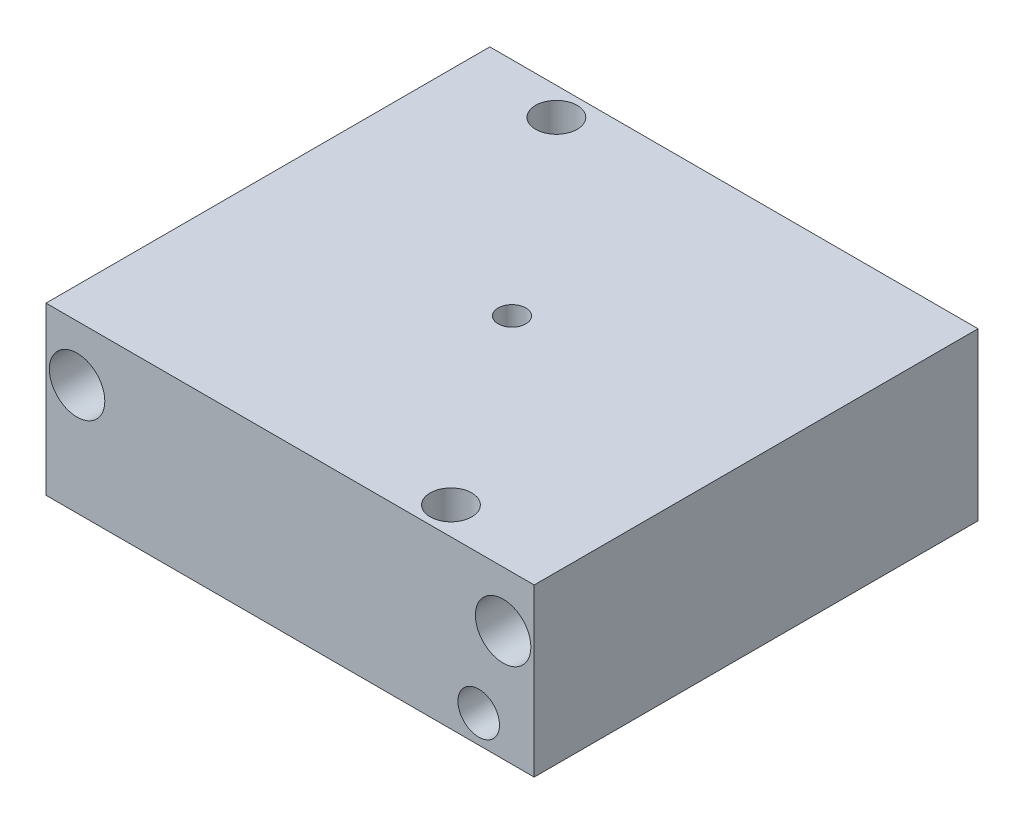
ISO-10303-21;
HEADER;
FILE_DESCRIPTION(('STEP AP214'),'2;1');
FILE_NAME('part.step','',(''),(''),'','','');
FILE_SCHEMA(('AUTOMOTIVE_DESIGN { 1 0 10303 214 1 1 1 1 }'));
ENDSEC;
DATA;
#1=APPLICATION_CONTEXT('core data for automotive mechanical design processes');
#2=APPLICATION_PROTOCOL_DEFINITION('international standard','automotive_design',2000,#1);
#3=PRODUCT_CONTEXT('',#1,'mechanical');
#4=PRODUCT('Part','Part','',(#3));
#5=PRODUCT_RELATED_PRODUCT_CATEGORY('part','',(#4));
#6=PRODUCT_DEFINITION_FORMATION('','',#4);
#7=PRODUCT_DEFINITION_CONTEXT('part definition',#1,'design');
#8=PRODUCT_DEFINITION('design','',#6,#7);
#9=PRODUCT_DEFINITION_SHAPE('','',#8);
#10=(LENGTH_UNIT() NAMED_UNIT(*) SI_UNIT(.MILLI.,.METRE.));
#11=(NAMED_UNIT(*) PLANE_ANGLE_UNIT() SI_UNIT($,.RADIAN.));
#12=(NAMED_UNIT(*) SI_UNIT($,.STERADIAN.) SOLID_ANGLE_UNIT());
#13=UNCERTAINTY_MEASURE_WITH_UNIT(LENGTH_MEASURE(1.E-05),#10,'distance_accuracy_value','');
#14=(GEOMETRIC_REPRESENTATION_CONTEXT(3) GLOBAL_UNCERTAINTY_ASSIGNED_CONTEXT((#13)) GLOBAL_UNIT_ASSIGNED_CONTEXT((#10,
#11,#12)) REPRESENTATION_CONTEXT('',''));
#15=CARTESIAN_POINT('',(0.,0.,0.));
#16=DIRECTION('',(0.,0.,1.));
#17=DIRECTION('',(1.,0.,0.));
#18=AXIS2_PLACEMENT_3D('',#15,#16,#17);
#19=CARTESIAN_POINT('',(-58.9430139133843,38.1,-69.2318832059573));
#20=DIRECTION('',(1.,0.,0.));
#21=DIRECTION('',(0.,0.,-1.));
#22=AXIS2_PLACEMENT_3D('',#19,#20,#21);
#23=PLANE('',#22);
#24=DIRECTION('',(0.,0.,1.));
#25=VECTOR('',#24,1.);
#26=CARTESIAN_POINT('',(-58.9430139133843,0.,-69.2318832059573));
#27=LINE('',#26,#25);
#28=CARTESIAN_POINT('',(-58.9430139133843,0.,-69.2318832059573));
#29=VERTEX_POINT('',#28);
#30=CARTESIAN_POINT('',(-58.9430139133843,0.,32.3681167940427));
#31=VERTEX_POINT('',#30);
#32=EDGE_CURVE('E78',#29,#31,#27,.T.);
#33=ORIENTED_EDGE('',*,*,#32,.T.);
#34=DIRECTION('',(0.,-1.,0.));
#35=VECTOR('',#34,1.);
#36=CARTESIAN_POINT('',(-58.9430139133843,38.1,32.3681167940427));
#37=LINE('',#36,#35);
#38=CARTESIAN_POINT('',(-58.9430139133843,38.1,32.3681167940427));
#39=VERTEX_POINT('',#38);
#40=EDGE_CURVE('E11',#39,#31,#37,.T.);
#41=ORIENTED_EDGE('',*,*,#40,.F.);
#42=DIRECTION('',(0.,0.,1.));
#43=VECTOR('',#42,1.);
#44=CARTESIAN_POINT('',(-58.9430139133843,38.1,-69.2318832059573));
#45=LINE('',#44,#43);
#46=CARTESIAN_POINT('',(-58.9430139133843,38.1,-69.2318832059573));
#47=VERTEX_POINT('',#46);
#48=EDGE_CURVE('E101',#47,#39,#45,.T.);
#49=ORIENTED_EDGE('',*,*,#48,.F.);
#50=DIRECTION('',(0.,-1.,0.));
#51=VECTOR('',#50,1.);
#52=CARTESIAN_POINT('',(-58.9430139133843,38.1,-69.2318832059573));
#53=LINE('',#52,#51);
#54=EDGE_CURVE('E90',#47,#29,#53,.T.);
#55=ORIENTED_EDGE('',*,*,#54,.T.);
#56=EDGE_LOOP('',(#33,#41,#49,#55));
#57=FACE_BOUND('',#56,.T.);
#58=ADVANCED_FACE('F32',(#57),#23,.F.);
#59=CARTESIAN_POINT('',(-58.9430139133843,38.1,32.3681167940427));
#60=DIRECTION('',(0.,0.,-1.));
#61=DIRECTION('',(-1.,0.,0.));
#62=AXIS2_PLACEMENT_3D('',#59,#60,#61);
#63=PLANE('',#62);
#64=CARTESIAN_POINT('',(-51.8310139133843,25.4,32.3681167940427));
#65=DIRECTION('',(0.,0.,1.));
#66=DIRECTION('',(1.,0.,0.));
#67=AXIS2_PLACEMENT_3D('',#64,#65,#66);
#68=CIRCLE('',#67,6.35);
#69=CARTESIAN_POINT('',(-45.4810139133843,25.4,32.3681167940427));
#70=VERTEX_POINT('',#69);
#71=EDGE_CURVE('E121',#70,#70,#68,.T.);
#72=ORIENTED_EDGE('',*,*,#71,.F.);
#73=EDGE_LOOP('',(#72));
#74=FACE_BOUND('',#73,.T.);
#75=CARTESIAN_POINT('',(45.7049860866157,25.3999999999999,32.3681167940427));
#76=DIRECTION('',(0.,0.,1.));
#77=DIRECTION('',(1.,0.,0.));
#78=AXIS2_PLACEMENT_3D('',#75,#76,#77);
#79=CIRCLE('',#78,6.35000000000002);
#80=CARTESIAN_POINT('',(52.0549860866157,25.3999999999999,32.3681167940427));
#81=VERTEX_POINT('',#80);
#82=EDGE_CURVE('E112',#81,#81,#79,.T.);
#83=ORIENTED_EDGE('',*,*,#82,.F.);
#84=EDGE_LOOP('',(#83));
#85=FACE_BOUND('',#84,.T.);
#86=CARTESIAN_POINT('',(40.1169860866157,6.35,32.3681167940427));
#87=DIRECTION('',(0.,0.,1.));
#88=DIRECTION('',(1.,0.,0.));
#89=AXIS2_PLACEMENT_3D('',#86,#87,#88);
#90=CIRCLE('',#89,4.7625);
#91=CARTESIAN_POINT('',(44.8794860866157,6.35,32.3681167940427));
#92=VERTEX_POINT('',#91);
#93=EDGE_CURVE('E94',#92,#92,#90,.T.);
#94=ORIENTED_EDGE('',*,*,#93,.F.);
#95=EDGE_LOOP('',(#94));
#96=FACE_BOUND('',#95,.T.);
#97=DIRECTION('',(1.,0.,0.));
#98=VECTOR('',#97,1.);
#99=CARTESIAN_POINT('',(-58.9430139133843,0.,32.3681167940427));
#100=LINE('',#99,#98);
#101=CARTESIAN_POINT('',(52.8169860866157,0.,32.3681167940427));
#102=VERTEX_POINT('',#101);
#103=EDGE_CURVE('E74',#31,#102,#100,.T.);
#104=ORIENTED_EDGE('',*,*,#103,.T.);
#105=DIRECTION('',(0.,-1.,0.));
#106=VECTOR('',#105,1.);
#107=CARTESIAN_POINT('',(52.8169860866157,38.1,32.3681167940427));
#108=LINE('',#107,#106);
#109=CARTESIAN_POINT('',(52.8169860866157,38.1,32.3681167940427));
#110=VERTEX_POINT('',#109);
#111=EDGE_CURVE('E40',#110,#102,#108,.T.);
#112=ORIENTED_EDGE('',*,*,#111,.F.);
#113=DIRECTION('',(1.,0.,0.));
#114=VECTOR('',#113,1.);
#115=CARTESIAN_POINT('',(-58.9430139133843,38.1,32.3681167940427));
#116=LINE('',#115,#114);
#117=EDGE_CURVE('E86',#39,#110,#116,.T.);
#118=ORIENTED_EDGE('',*,*,#117,.F.);
#119=ORIENTED_EDGE('',*,*,#40,.T.);
#120=EDGE_LOOP('',(#104,#112,#118,#119));
#121=FACE_BOUND('',#120,.T.);
#122=ADVANCED_FACE('F85',(#74,#85,#96,#121),#63,.F.);
#123=CARTESIAN_POINT('',(52.8169860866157,38.1,-69.2318832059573));
#124=DIRECTION('',(-1.,0.,0.));
#125=DIRECTION('',(0.,0.,1.));
#126=AXIS2_PLACEMENT_3D('',#123,#124,#125);
#127=PLANE('',#126);
#128=DIRECTION('',(0.,0.,-1.));
#129=VECTOR('',#128,1.);
#130=CARTESIAN_POINT('',(52.8169860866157,0.,-69.2318832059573));
#131=LINE('',#130,#129);
#132=CARTESIAN_POINT('',(52.8169860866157,0.,-69.2318832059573));
#133=VERTEX_POINT('',#132);
#134=EDGE_CURVE('E79',#102,#133,#131,.T.);
#135=ORIENTED_EDGE('',*,*,#134,.T.);
#136=DIRECTION('',(0.,-1.,0.));
#137=VECTOR('',#136,1.);
#138=CARTESIAN_POINT('',(52.8169860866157,38.1,-69.2318832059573));
#139=LINE('',#138,#137);
#140=CARTESIAN_POINT('',(52.8169860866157,38.1,-69.2318832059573));
#141=VERTEX_POINT('',#140);
#142=EDGE_CURVE('E107',#141,#133,#139,.T.);
#143=ORIENTED_EDGE('',*,*,#142,.F.);
#144=DIRECTION('',(0.,0.,-1.));
#145=VECTOR('',#144,1.);
#146=CARTESIAN_POINT('',(52.8169860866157,38.1,-69.2318832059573));
#147=LINE('',#146,#145);
#148=EDGE_CURVE('E53',#110,#141,#147,.T.);
#149=ORIENTED_EDGE('',*,*,#148,.F.);
#150=ORIENTED_EDGE('',*,*,#111,.T.);
#151=EDGE_LOOP('',(#135,#143,#149,#150));
#152=FACE_BOUND('',#151,.T.);
#153=ADVANCED_FACE('F155',(#152),#127,.F.);
#154=CARTESIAN_POINT('',(-58.9430139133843,38.1,-69.2318832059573));
#155=DIRECTION('',(0.,0.,1.));
#156=DIRECTION('',(1.,0.,0.));
#157=AXIS2_PLACEMENT_3D('',#154,#155,#156);
#158=PLANE('',#157);
#159=CARTESIAN_POINT('',(-51.8310139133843,25.4,-69.2318832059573));
#160=DIRECTION('',(0.,0.,1.));
#161=DIRECTION('',(1.,0.,0.));
#162=AXIS2_PLACEMENT_3D('',#159,#160,#161);
#163=CIRCLE('',#162,6.35);
#164=CARTESIAN_POINT('',(-45.4810139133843,25.4,-69.2318832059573));
#165=VERTEX_POINT('',#164);
#166=EDGE_CURVE('E35',#165,#165,#163,.T.);
#167=ORIENTED_EDGE('',*,*,#166,.T.);
#168=EDGE_LOOP('',(#167));
#169=FACE_BOUND('',#168,.T.);
#170=CARTESIAN_POINT('',(45.7049860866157,25.3999999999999,-69.2318832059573));
#171=DIRECTION('',(0.,0.,1.));
#172=DIRECTION('',(1.,0.,0.));
#173=AXIS2_PLACEMENT_3D('',#170,#171,#172);
#174=CIRCLE('',#173,6.35000000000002);
#175=CARTESIAN_POINT('',(52.0549860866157,25.3999999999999,-69.2318832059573));
#176=VERTEX_POINT('',#175);
#177=EDGE_CURVE('E110',#176,#176,#174,.T.);
#178=ORIENTED_EDGE('',*,*,#177,.T.);
#179=EDGE_LOOP('',(#178));
#180=FACE_BOUND('',#179,.T.);
#181=CARTESIAN_POINT('',(40.1169860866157,6.35,-69.2318832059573));
#182=DIRECTION('',(0.,0.,1.));
#183=DIRECTION('',(1.,0.,0.));
#184=AXIS2_PLACEMENT_3D('',#181,#182,#183);
#185=CIRCLE('',#184,4.7625);
#186=CARTESIAN_POINT('',(44.8794860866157,6.35,-69.2318832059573));
#187=VERTEX_POINT('',#186);
#188=EDGE_CURVE('E91',#187,#187,#185,.T.);
#189=ORIENTED_EDGE('',*,*,#188,.T.);
#190=EDGE_LOOP('',(#189));
#191=FACE_BOUND('',#190,.T.);
#192=DIRECTION('',(-1.,0.,0.));
#193=VECTOR('',#192,1.);
#194=CARTESIAN_POINT('',(-58.9430139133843,0.,-69.2318832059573));
#195=LINE('',#194,#193);
#196=EDGE_CURVE('E99',#133,#29,#195,.T.);
#197=ORIENTED_EDGE('',*,*,#196,.T.);
#198=ORIENTED_EDGE('',*,*,#54,.F.);
#199=DIRECTION('',(-1.,0.,0.));
#200=VECTOR('',#199,1.);
#201=CARTESIAN_POINT('',(-58.9430139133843,38.1,-69.2318832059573));
#202=LINE('',#201,#200);
#203=EDGE_CURVE('E48',#141,#47,#202,.T.);
#204=ORIENTED_EDGE('',*,*,#203,.F.);
#205=ORIENTED_EDGE('',*,*,#142,.T.);
#206=EDGE_LOOP('',(#197,#198,#204,#205));
#207=FACE_BOUND('',#206,.T.);
#208=ADVANCED_FACE('F149',(#169,#180,#191,#207),#158,.F.);
#209=CARTESIAN_POINT('',(-58.9430139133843,38.1,32.3681167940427));
#210=DIRECTION('',(0.,1.,0.));
#211=DIRECTION('',(0.,0.,1.));
#212=AXIS2_PLACEMENT_3D('',#209,#210,#211);
#213=PLANE('',#212);
#214=CARTESIAN_POINT('',(-3.06301391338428,38.1,-18.4318832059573));
#215=DIRECTION('',(0.,1.,0.));
#216=DIRECTION('',(0.,0.,1.));
#217=AXIS2_PLACEMENT_3D('',#214,#215,#216);
#218=CIRCLE('',#217,3.175);
#219=CARTESIAN_POINT('',(-3.06301391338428,38.1,-15.2568832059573));
#220=VERTEX_POINT('',#219);
#221=EDGE_CURVE('E140',#220,#220,#218,.T.);
#222=ORIENTED_EDGE('',*,*,#221,.F.);
#223=EDGE_LOOP('',(#222));
#224=FACE_BOUND('',#223,.T.);
#225=CARTESIAN_POINT('',(-37.3530139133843,38.1,-62.8818832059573));
#226=DIRECTION('',(0.,1.,0.));
#227=DIRECTION('',(0.,0.,1.));
#228=AXIS2_PLACEMENT_3D('',#225,#226,#227);
#229=CIRCLE('',#228,4.7625);
#230=CARTESIAN_POINT('',(-37.3530139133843,38.1,-58.1193832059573));
#231=VERTEX_POINT('',#230);
#232=EDGE_CURVE('E134',#231,#231,#229,.T.);
#233=ORIENTED_EDGE('',*,*,#232,.F.);
#234=EDGE_LOOP('',(#233));
#235=FACE_BOUND('',#234,.T.);
#236=CARTESIAN_POINT('',(27.4169860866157,38.1,26.0181167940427));
#237=DIRECTION('',(0.,1.,0.));
#238=DIRECTION('',(0.,0.,1.));
#239=AXIS2_PLACEMENT_3D('',#236,#237,#238);
#240=CIRCLE('',#239,4.7625);
#241=CARTESIAN_POINT('',(27.4169860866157,38.1,30.7806167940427));
#242=VERTEX_POINT('',#241);
#243=EDGE_CURVE('E128',#242,#242,#240,.T.);
#244=ORIENTED_EDGE('',*,*,#243,.F.);
#245=EDGE_LOOP('',(#244));
#246=FACE_BOUND('',#245,.T.);
#247=ORIENTED_EDGE('',*,*,#48,.T.);
#248=ORIENTED_EDGE('',*,*,#117,.T.);
#249=ORIENTED_EDGE('',*,*,#148,.T.);
#250=ORIENTED_EDGE('',*,*,#203,.T.);
#251=EDGE_LOOP('',(#247,#248,#249,#250));
#252=FACE_BOUND('',#251,.T.);
#253=ADVANCED_FACE('F146',(#224,#235,#246,#252),#213,.T.);
#254=CARTESIAN_POINT('',(-58.9430139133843,0.,32.3681167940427));
#255=DIRECTION('',(0.,1.,0.));
#256=DIRECTION('',(0.,0.,1.));
#257=AXIS2_PLACEMENT_3D('',#254,#255,#256);
#258=PLANE('',#257);
#259=CARTESIAN_POINT('',(-3.06301391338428,0.,-18.4318832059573));
#260=DIRECTION('',(0.,1.,0.));
#261=DIRECTION('',(0.,0.,1.));
#262=AXIS2_PLACEMENT_3D('',#259,#260,#261);
#263=CIRCLE('',#262,3.175);
#264=CARTESIAN_POINT('',(-3.06301391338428,0.,-15.2568832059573));
#265=VERTEX_POINT('',#264);
#266=EDGE_CURVE('E137',#265,#265,#263,.T.);
#267=ORIENTED_EDGE('',*,*,#266,.T.);
#268=EDGE_LOOP('',(#267));
#269=FACE_BOUND('',#268,.T.);
#270=CARTESIAN_POINT('',(-37.3530139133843,0.,-62.8818832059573));
#271=DIRECTION('',(0.,1.,0.));
#272=DIRECTION('',(0.,0.,1.));
#273=AXIS2_PLACEMENT_3D('',#270,#271,#272);
#274=CIRCLE('',#273,4.7625);
#275=CARTESIAN_POINT('',(-37.3530139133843,0.,-58.1193832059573));
#276=VERTEX_POINT('',#275);
#277=EDGE_CURVE('E131',#276,#276,#274,.T.);
#278=ORIENTED_EDGE('',*,*,#277,.T.);
#279=EDGE_LOOP('',(#278));
#280=FACE_BOUND('',#279,.T.);
#281=CARTESIAN_POINT('',(27.4169860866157,0.,26.0181167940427));
#282=DIRECTION('',(0.,1.,0.));
#283=DIRECTION('',(0.,0.,1.));
#284=AXIS2_PLACEMENT_3D('',#281,#282,#283);
#285=CIRCLE('',#284,4.7625);
#286=CARTESIAN_POINT('',(27.4169860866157,0.,30.7806167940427));
#287=VERTEX_POINT('',#286);
#288=EDGE_CURVE('E125',#287,#287,#285,.T.);
#289=ORIENTED_EDGE('',*,*,#288,.T.);
#290=EDGE_LOOP('',(#289));
#291=FACE_BOUND('',#290,.T.);
#292=ORIENTED_EDGE('',*,*,#32,.F.);
#293=ORIENTED_EDGE('',*,*,#196,.F.);
#294=ORIENTED_EDGE('',*,*,#134,.F.);
#295=ORIENTED_EDGE('',*,*,#103,.F.);
#296=EDGE_LOOP('',(#292,#293,#294,#295));
#297=FACE_BOUND('',#296,.T.);
#298=ADVANCED_FACE('F75',(#269,#280,#291,#297),#258,.F.);
#299=CARTESIAN_POINT('',(40.1169860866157,6.35,-69.2318832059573));
#300=DIRECTION('',(0.,0.,1.));
#301=DIRECTION('',(1.,0.,0.));
#302=AXIS2_PLACEMENT_3D('',#299,#300,#301);
#303=CYLINDRICAL_SURFACE('',#302,4.7625);
#304=ORIENTED_EDGE('',*,*,#188,.F.);
#305=EDGE_LOOP('',(#304));
#306=FACE_BOUND('',#305,.T.);
#307=ORIENTED_EDGE('',*,*,#93,.T.);
#308=EDGE_LOOP('',(#307));
#309=FACE_BOUND('',#308,.T.);
#310=ADVANCED_FACE('F176',(#306,#309),#303,.F.);
#311=CARTESIAN_POINT('',(45.7049860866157,25.3999999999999,-158.131883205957));
#312=DIRECTION('',(0.,0.,1.));
#313=DIRECTION('',(1.,0.,0.));
#314=AXIS2_PLACEMENT_3D('',#311,#312,#313);
#315=CYLINDRICAL_SURFACE('',#314,6.35000000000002);
#316=ORIENTED_EDGE('',*,*,#82,.T.);
#317=EDGE_LOOP('',(#316));
#318=FACE_BOUND('',#317,.T.);
#319=ORIENTED_EDGE('',*,*,#177,.F.);
#320=EDGE_LOOP('',(#319));
#321=FACE_BOUND('',#320,.T.);
#322=ADVANCED_FACE('F178',(#318,#321),#315,.F.);
#323=CARTESIAN_POINT('',(-51.8310139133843,25.4,-158.131883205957));
#324=DIRECTION('',(0.,0.,1.));
#325=DIRECTION('',(1.,0.,0.));
#326=AXIS2_PLACEMENT_3D('',#323,#324,#325);
#327=CYLINDRICAL_SURFACE('',#326,6.35);
#328=ORIENTED_EDGE('',*,*,#71,.T.);
#329=EDGE_LOOP('',(#328));
#330=FACE_BOUND('',#329,.T.);
#331=ORIENTED_EDGE('',*,*,#166,.F.);
#332=EDGE_LOOP('',(#331));
#333=FACE_BOUND('',#332,.T.);
#334=ADVANCED_FACE('F185',(#330,#333),#327,.F.);
#335=CARTESIAN_POINT('',(27.4169860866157,0.,26.0181167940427));
#336=DIRECTION('',(0.,1.,0.));
#337=DIRECTION('',(0.,0.,1.));
#338=AXIS2_PLACEMENT_3D('',#335,#336,#337);
#339=CYLINDRICAL_SURFACE('',#338,4.7625);
#340=CARTESIAN_POINT('',(27.4169860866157,0.,30.7806167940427));
#341=CARTESIAN_POINT('',(27.4169860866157,0.396875,30.7806167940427));
#342=CARTESIAN_POINT('',(27.4169860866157,0.79375,30.7806167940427));
#343=CARTESIAN_POINT('',(27.4169860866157,1.5875,30.7806167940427));
#344=CARTESIAN_POINT('',(27.4169860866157,1.984375,30.7806167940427));
#345=CARTESIAN_POINT('',(27.4169860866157,2.778125,30.7806167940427));
#346=CARTESIAN_POINT('',(27.4169860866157,3.175,30.7806167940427));
#347=CARTESIAN_POINT('',(27.4169860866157,3.96875,30.7806167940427));
#348=CARTESIAN_POINT('',(27.4169860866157,4.365625,30.7806167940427));
#349=CARTESIAN_POINT('',(27.4169860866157,5.159375,30.7806167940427));
#350=CARTESIAN_POINT('',(27.4169860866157,5.55625,30.7806167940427));
#351=CARTESIAN_POINT('',(27.4169860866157,6.35,30.7806167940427));
#352=CARTESIAN_POINT('',(27.4169860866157,6.746875,30.7806167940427));
#353=CARTESIAN_POINT('',(27.4169860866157,7.540625,30.7806167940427));
#354=CARTESIAN_POINT('',(27.4169860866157,7.9375,30.7806167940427));
#355=CARTESIAN_POINT('',(27.4169860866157,8.73125,30.7806167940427));
#356=CARTESIAN_POINT('',(27.4169860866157,9.128125,30.7806167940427));
#357=CARTESIAN_POINT('',(27.4169860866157,9.921875,30.7806167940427));
#358=CARTESIAN_POINT('',(27.4169860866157,10.31875,30.7806167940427));
#359=CARTESIAN_POINT('',(27.4169860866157,11.1125,30.7806167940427));
#360=CARTESIAN_POINT('',(27.4169860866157,11.509375,30.7806167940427));
#361=CARTESIAN_POINT('',(27.4169860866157,12.303125,30.7806167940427));
#362=CARTESIAN_POINT('',(27.4169860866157,12.7,30.7806167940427));
#363=CARTESIAN_POINT('',(27.4169860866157,13.49375,30.7806167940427));
#364=CARTESIAN_POINT('',(27.4169860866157,13.890625,30.7806167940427));
#365=CARTESIAN_POINT('',(27.4169860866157,14.684375,30.7806167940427));
#366=CARTESIAN_POINT('',(27.4169860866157,15.08125,30.7806167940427));
#367=CARTESIAN_POINT('',(27.4169860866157,15.875,30.7806167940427));
#368=CARTESIAN_POINT('',(27.4169860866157,16.271875,30.7806167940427));
#369=CARTESIAN_POINT('',(27.4169860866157,17.065625,30.7806167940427));
#370=CARTESIAN_POINT('',(27.4169860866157,17.4625,30.7806167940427));
#371=CARTESIAN_POINT('',(27.4169860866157,18.25625,30.7806167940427));
#372=CARTESIAN_POINT('',(27.4169860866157,18.653125,30.7806167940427));
#373=CARTESIAN_POINT('',(27.4169860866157,19.446875,30.7806167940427));
#374=CARTESIAN_POINT('',(27.4169860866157,19.84375,30.7806167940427));
#375=CARTESIAN_POINT('',(27.4169860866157,20.6375,30.7806167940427));
#376=CARTESIAN_POINT('',(27.4169860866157,21.034375,30.7806167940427));
#377=CARTESIAN_POINT('',(27.4169860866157,21.828125,30.7806167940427));
#378=CARTESIAN_POINT('',(27.4169860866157,22.225,30.7806167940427));
#379=CARTESIAN_POINT('',(27.4169860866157,23.01875,30.7806167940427));
#380=CARTESIAN_POINT('',(27.4169860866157,23.415625,30.7806167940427));
#381=CARTESIAN_POINT('',(27.4169860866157,24.209375,30.7806167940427));
#382=CARTESIAN_POINT('',(27.4169860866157,24.60625,30.7806167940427));
#383=CARTESIAN_POINT('',(27.4169860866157,25.4,30.7806167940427));
#384=CARTESIAN_POINT('',(27.4169860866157,25.796875,30.7806167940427));
#385=CARTESIAN_POINT('',(27.4169860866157,26.590625,30.7806167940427));
#386=CARTESIAN_POINT('',(27.4169860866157,26.9875,30.7806167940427));
#387=CARTESIAN_POINT('',(27.4169860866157,27.78125,30.7806167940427));
#388=CARTESIAN_POINT('',(27.4169860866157,28.178125,30.7806167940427));
#389=CARTESIAN_POINT('',(27.4169860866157,28.971875,30.7806167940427));
#390=CARTESIAN_POINT('',(27.4169860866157,29.36875,30.7806167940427));
#391=CARTESIAN_POINT('',(27.4169860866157,30.1625,30.7806167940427));
#392=CARTESIAN_POINT('',(27.4169860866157,30.559375,30.7806167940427));
#393=CARTESIAN_POINT('',(27.4169860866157,31.353125,30.7806167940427));
#394=CARTESIAN_POINT('',(27.4169860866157,31.75,30.7806167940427));
#395=CARTESIAN_POINT('',(27.4169860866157,32.54375,30.7806167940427));
#396=CARTESIAN_POINT('',(27.4169860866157,32.940625,30.7806167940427));
#397=CARTESIAN_POINT('',(27.4169860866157,33.734375,30.7806167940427));
#398=CARTESIAN_POINT('',(27.4169860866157,34.13125,30.7806167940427));
#399=CARTESIAN_POINT('',(27.4169860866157,34.925,30.7806167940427));
#400=CARTESIAN_POINT('',(27.4169860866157,35.321875,30.7806167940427));
#401=CARTESIAN_POINT('',(27.4169860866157,36.115625,30.7806167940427));
#402=CARTESIAN_POINT('',(27.4169860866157,36.5125,30.7806167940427));
#403=CARTESIAN_POINT('',(27.4169860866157,37.30625,30.7806167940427));
#404=CARTESIAN_POINT('',(27.4169860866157,37.703125,30.7806167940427));
#405=CARTESIAN_POINT('',(27.4169860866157,38.1,30.7806167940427));
#406=B_SPLINE_CURVE_WITH_KNOTS('',3,(#340,#341,#342,#343,#344,#345,#346,#347,#348,#349,#350,
#351,#352,#353,#354,#355,#356,#357,#358,#359,#360,#361,#362,#363,#364,#365,#366,#367,#368,#369,
#370,#371,#372,#373,#374,#375,#376,#377,#378,#379,#380,#381,#382,#383,#384,#385,#386,#387,#388,
#389,#390,#391,#392,#393,#394,#395,#396,#397,#398,#399,#400,#401,#402,#403,#404,#405),
.UNSPECIFIED.,.F.,.F.,(4,2,2,2,2,2,2,2,2,2,2,2,2,2,2,2,2,2,2,2,2,2,2,2,2,2,2,2,2,2,2,2,4),(0.,
1.190625,2.38125,3.571875,4.7625,5.953125,7.14375,8.334375,9.525,10.715625,11.90625,13.096875,
14.2875,15.478125,16.66875,17.859375,19.05,20.240625,21.43125,22.621875,23.8125,25.003125,
26.19375,27.384375,28.575,29.765625,30.95625,32.146875,33.3375,34.528125,35.71875,36.909375,
38.1),.UNSPECIFIED.);
#407=EDGE_CURVE('BSEAM193',#287,#242,#406,.T.);
#408=ORIENTED_EDGE('',*,*,#288,.F.);
#409=ORIENTED_EDGE('',*,*,#243,.T.);
#410=ORIENTED_EDGE('',*,*,#407,.T.);
#411=ORIENTED_EDGE('',*,*,#407,.F.);
#412=EDGE_LOOP('',(#408,#410,#409,#411));
#413=FACE_BOUND('',#412,.T.);
#414=ADVANCED_FACE('F193',(#413),#339,.F.);
#415=CARTESIAN_POINT('',(-37.3530139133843,0.,-62.8818832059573));
#416=DIRECTION('',(0.,1.,0.));
#417=DIRECTION('',(0.,0.,1.));
#418=AXIS2_PLACEMENT_3D('',#415,#416,#417);
#419=CYLINDRICAL_SURFACE('',#418,4.7625);
#420=CARTESIAN_POINT('',(-37.3530139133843,0.,-58.1193832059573));
#421=CARTESIAN_POINT('',(-37.3530139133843,0.396875,-58.1193832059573));
#422=CARTESIAN_POINT('',(-37.3530139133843,0.79375,-58.1193832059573));
#423=CARTESIAN_POINT('',(-37.3530139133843,1.5875,-58.1193832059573));
#424=CARTESIAN_POINT('',(-37.3530139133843,1.984375,-58.1193832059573));
#425=CARTESIAN_POINT('',(-37.3530139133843,2.778125,-58.1193832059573));
#426=CARTESIAN_POINT('',(-37.3530139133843,3.175,-58.1193832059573));
#427=CARTESIAN_POINT('',(-37.3530139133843,3.96875,-58.1193832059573));
#428=CARTESIAN_POINT('',(-37.3530139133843,4.365625,-58.1193832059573));
#429=CARTESIAN_POINT('',(-37.3530139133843,5.159375,-58.1193832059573));
#430=CARTESIAN_POINT('',(-37.3530139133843,5.55625,-58.1193832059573));
#431=CARTESIAN_POINT('',(-37.3530139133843,6.35,-58.1193832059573));
#432=CARTESIAN_POINT('',(-37.3530139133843,6.746875,-58.1193832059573));
#433=CARTESIAN_POINT('',(-37.3530139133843,7.540625,-58.1193832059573));
#434=CARTESIAN_POINT('',(-37.3530139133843,7.9375,-58.1193832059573));
#435=CARTESIAN_POINT('',(-37.3530139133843,8.73125,-58.1193832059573));
#436=CARTESIAN_POINT('',(-37.3530139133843,9.128125,-58.1193832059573));
#437=CARTESIAN_POINT('',(-37.3530139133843,9.921875,-58.1193832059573));
#438=CARTESIAN_POINT('',(-37.3530139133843,10.31875,-58.1193832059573));
#439=CARTESIAN_POINT('',(-37.3530139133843,11.1125,-58.1193832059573));
#440=CARTESIAN_POINT('',(-37.3530139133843,11.509375,-58.1193832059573));
#441=CARTESIAN_POINT('',(-37.3530139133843,12.303125,-58.1193832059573));
#442=CARTESIAN_POINT('',(-37.3530139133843,12.7,-58.1193832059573));
#443=CARTESIAN_POINT('',(-37.3530139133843,13.49375,-58.1193832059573));
#444=CARTESIAN_POINT('',(-37.3530139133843,13.890625,-58.1193832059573));
#445=CARTESIAN_POINT('',(-37.3530139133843,14.684375,-58.1193832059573));
#446=CARTESIAN_POINT('',(-37.3530139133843,15.08125,-58.1193832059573));
#447=CARTESIAN_POINT('',(-37.3530139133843,15.875,-58.1193832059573));
#448=CARTESIAN_POINT('',(-37.3530139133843,16.271875,-58.1193832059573));
#449=CARTESIAN_POINT('',(-37.3530139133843,17.065625,-58.1193832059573));
#450=CARTESIAN_POINT('',(-37.3530139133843,17.4625,-58.1193832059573));
#451=CARTESIAN_POINT('',(-37.3530139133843,18.25625,-58.1193832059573));
#452=CARTESIAN_POINT('',(-37.3530139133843,18.653125,-58.1193832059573));
#453=CARTESIAN_POINT('',(-37.3530139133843,19.446875,-58.1193832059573));
#454=CARTESIAN_POINT('',(-37.3530139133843,19.84375,-58.1193832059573));
#455=CARTESIAN_POINT('',(-37.3530139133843,20.6375,-58.1193832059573));
#456=CARTESIAN_POINT('',(-37.3530139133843,21.034375,-58.1193832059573));
#457=CARTESIAN_POINT('',(-37.3530139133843,21.828125,-58.1193832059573));
#458=CARTESIAN_POINT('',(-37.3530139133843,22.225,-58.1193832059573));
#459=CARTESIAN_POINT('',(-37.3530139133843,23.01875,-58.1193832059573));
#460=CARTESIAN_POINT('',(-37.3530139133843,23.415625,-58.1193832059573));
#461=CARTESIAN_POINT('',(-37.3530139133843,24.209375,-58.1193832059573));
#462=CARTESIAN_POINT('',(-37.3530139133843,24.60625,-58.1193832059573));
#463=CARTESIAN_POINT('',(-37.3530139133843,25.4,-58.1193832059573));
#464=CARTESIAN_POINT('',(-37.3530139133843,25.796875,-58.1193832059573));
#465=CARTESIAN_POINT('',(-37.3530139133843,26.590625,-58.1193832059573));
#466=CARTESIAN_POINT('',(-37.3530139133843,26.9875,-58.1193832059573));
#467=CARTESIAN_POINT('',(-37.3530139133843,27.78125,-58.1193832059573));
#468=CARTESIAN_POINT('',(-37.3530139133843,28.178125,-58.1193832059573));
#469=CARTESIAN_POINT('',(-37.3530139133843,28.971875,-58.1193832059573));
#470=CARTESIAN_POINT('',(-37.3530139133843,29.36875,-58.1193832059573));
#471=CARTESIAN_POINT('',(-37.3530139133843,30.1625,-58.1193832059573));
#472=CARTESIAN_POINT('',(-37.3530139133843,30.559375,-58.1193832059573));
#473=CARTESIAN_POINT('',(-37.3530139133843,31.353125,-58.1193832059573));
#474=CARTESIAN_POINT('',(-37.3530139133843,31.75,-58.1193832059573));
#475=CARTESIAN_POINT('',(-37.3530139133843,32.54375,-58.1193832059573));
#476=CARTESIAN_POINT('',(-37.3530139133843,32.940625,-58.1193832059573));
#477=CARTESIAN_POINT('',(-37.3530139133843,33.734375,-58.1193832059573));
#478=CARTESIAN_POINT('',(-37.3530139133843,34.13125,-58.1193832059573));
#479=CARTESIAN_POINT('',(-37.3530139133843,34.925,-58.1193832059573));
#480=CARTESIAN_POINT('',(-37.3530139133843,35.321875,-58.1193832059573));
#481=CARTESIAN_POINT('',(-37.3530139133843,36.115625,-58.1193832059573));
#482=CARTESIAN_POINT('',(-37.3530139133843,36.5125,-58.1193832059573));
#483=CARTESIAN_POINT('',(-37.3530139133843,37.30625,-58.1193832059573));
#484=CARTESIAN_POINT('',(-37.3530139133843,37.703125,-58.1193832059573));
#485=CARTESIAN_POINT('',(-37.3530139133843,38.1,-58.1193832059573));
#486=B_SPLINE_CURVE_WITH_KNOTS('',3,(#420,#421,#422,#423,#424,#425,#426,#427,#428,#429,#430,
#431,#432,#433,#434,#435,#436,#437,#438,#439,#440,#441,#442,#443,#444,#445,#446,#447,#448,#449,
#450,#451,#452,#453,#454,#455,#456,#457,#458,#459,#460,#461,#462,#463,#464,#465,#466,#467,#468,
#469,#470,#471,#472,#473,#474,#475,#476,#477,#478,#479,#480,#481,#482,#483,#484,#485),
.UNSPECIFIED.,.F.,.F.,(4,2,2,2,2,2,2,2,2,2,2,2,2,2,2,2,2,2,2,2,2,2,2,2,2,2,2,2,2,2,2,2,4),(0.,
1.190625,2.38125,3.571875,4.7625,5.953125,7.14375,8.334375,9.525,10.715625,11.90625,13.096875,
14.2875,15.478125,16.66875,17.859375,19.05,20.240625,21.43125,22.621875,23.8125,25.003125,
26.19375,27.384375,28.575,29.765625,30.95625,32.146875,33.3375,34.528125,35.71875,36.909375,
38.1),.UNSPECIFIED.);
#487=EDGE_CURVE('BSEAM197',#276,#231,#486,.T.);
#488=ORIENTED_EDGE('',*,*,#277,.F.);
#489=ORIENTED_EDGE('',*,*,#232,.T.);
#490=ORIENTED_EDGE('',*,*,#487,.T.);
#491=ORIENTED_EDGE('',*,*,#487,.F.);
#492=EDGE_LOOP('',(#488,#490,#489,#491));
#493=FACE_BOUND('',#492,.T.);
#494=ADVANCED_FACE('F197',(#493),#419,.F.);
#495=CARTESIAN_POINT('',(-3.06301391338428,0.,-18.4318832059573));
#496=DIRECTION('',(0.,1.,0.));
#497=DIRECTION('',(0.,0.,1.));
#498=AXIS2_PLACEMENT_3D('',#495,#496,#497);
#499=CYLINDRICAL_SURFACE('',#498,3.175);
#500=CARTESIAN_POINT('',(-3.06301391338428,0.,-15.2568832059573));
#501=CARTESIAN_POINT('',(-3.06301391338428,0.396875,-15.2568832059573));
#502=CARTESIAN_POINT('',(-3.06301391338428,0.79375,-15.2568832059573));
#503=CARTESIAN_POINT('',(-3.06301391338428,1.5875,-15.2568832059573));
#504=CARTESIAN_POINT('',(-3.06301391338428,1.984375,-15.2568832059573));
#505=CARTESIAN_POINT('',(-3.06301391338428,2.778125,-15.2568832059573));
#506=CARTESIAN_POINT('',(-3.06301391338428,3.175,-15.2568832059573));
#507=CARTESIAN_POINT('',(-3.06301391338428,3.96875,-15.2568832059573));
#508=CARTESIAN_POINT('',(-3.06301391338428,4.365625,-15.2568832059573));
#509=CARTESIAN_POINT('',(-3.06301391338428,5.159375,-15.2568832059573));
#510=CARTESIAN_POINT('',(-3.06301391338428,5.55625,-15.2568832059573));
#511=CARTESIAN_POINT('',(-3.06301391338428,6.35,-15.2568832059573));
#512=CARTESIAN_POINT('',(-3.06301391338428,6.746875,-15.2568832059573));
#513=CARTESIAN_POINT('',(-3.06301391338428,7.540625,-15.2568832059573));
#514=CARTESIAN_POINT('',(-3.06301391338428,7.9375,-15.2568832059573));
#515=CARTESIAN_POINT('',(-3.06301391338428,8.73125,-15.2568832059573));
#516=CARTESIAN_POINT('',(-3.06301391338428,9.128125,-15.2568832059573));
#517=CARTESIAN_POINT('',(-3.06301391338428,9.921875,-15.2568832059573));
#518=CARTESIAN_POINT('',(-3.06301391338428,10.31875,-15.2568832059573));
#519=CARTESIAN_POINT('',(-3.06301391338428,11.1125,-15.2568832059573));
#520=CARTESIAN_POINT('',(-3.06301391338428,11.509375,-15.2568832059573));
#521=CARTESIAN_POINT('',(-3.06301391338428,12.303125,-15.2568832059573));
#522=CARTESIAN_POINT('',(-3.06301391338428,12.7,-15.2568832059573));
#523=CARTESIAN_POINT('',(-3.06301391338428,13.49375,-15.2568832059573));
#524=CARTESIAN_POINT('',(-3.06301391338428,13.890625,-15.2568832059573));
#525=CARTESIAN_POINT('',(-3.06301391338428,14.684375,-15.2568832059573));
#526=CARTESIAN_POINT('',(-3.06301391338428,15.08125,-15.2568832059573));
#527=CARTESIAN_POINT('',(-3.06301391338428,15.875,-15.2568832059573));
#528=CARTESIAN_POINT('',(-3.06301391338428,16.271875,-15.2568832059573));
#529=CARTESIAN_POINT('',(-3.06301391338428,17.065625,-15.2568832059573));
#530=CARTESIAN_POINT('',(-3.06301391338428,17.4625,-15.2568832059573));
#531=CARTESIAN_POINT('',(-3.06301391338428,18.25625,-15.2568832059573));
#532=CARTESIAN_POINT('',(-3.06301391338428,18.653125,-15.2568832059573));
#533=CARTESIAN_POINT('',(-3.06301391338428,19.446875,-15.2568832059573));
#534=CARTESIAN_POINT('',(-3.06301391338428,19.84375,-15.2568832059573));
#535=CARTESIAN_POINT('',(-3.06301391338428,20.6375,-15.2568832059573));
#536=CARTESIAN_POINT('',(-3.06301391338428,21.034375,-15.2568832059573));
#537=CARTESIAN_POINT('',(-3.06301391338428,21.828125,-15.2568832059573));
#538=CARTESIAN_POINT('',(-3.06301391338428,22.225,-15.2568832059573));
#539=CARTESIAN_POINT('',(-3.06301391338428,23.01875,-15.2568832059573));
#540=CARTESIAN_POINT('',(-3.06301391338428,23.415625,-15.2568832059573));
#541=CARTESIAN_POINT('',(-3.06301391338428,24.209375,-15.2568832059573));
#542=CARTESIAN_POINT('',(-3.06301391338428,24.60625,-15.2568832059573));
#543=CARTESIAN_POINT('',(-3.06301391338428,25.4,-15.2568832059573));
#544=CARTESIAN_POINT('',(-3.06301391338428,25.796875,-15.2568832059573));
#545=CARTESIAN_POINT('',(-3.06301391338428,26.590625,-15.2568832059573));
#546=CARTESIAN_POINT('',(-3.06301391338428,26.9875,-15.2568832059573));
#547=CARTESIAN_POINT('',(-3.06301391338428,27.78125,-15.2568832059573));
#548=CARTESIAN_POINT('',(-3.06301391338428,28.178125,-15.2568832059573));
#549=CARTESIAN_POINT('',(-3.06301391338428,28.971875,-15.2568832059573));
#550=CARTESIAN_POINT('',(-3.06301391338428,29.36875,-15.2568832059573));
#551=CARTESIAN_POINT('',(-3.06301391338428,30.1625,-15.2568832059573));
#552=CARTESIAN_POINT('',(-3.06301391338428,30.559375,-15.2568832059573));
#553=CARTESIAN_POINT('',(-3.06301391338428,31.353125,-15.2568832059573));
#554=CARTESIAN_POINT('',(-3.06301391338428,31.75,-15.2568832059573));
#555=CARTESIAN_POINT('',(-3.06301391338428,32.54375,-15.2568832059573));
#556=CARTESIAN_POINT('',(-3.06301391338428,32.940625,-15.2568832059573));
#557=CARTESIAN_POINT('',(-3.06301391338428,33.734375,-15.2568832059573));
#558=CARTESIAN_POINT('',(-3.06301391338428,34.13125,-15.2568832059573));
#559=CARTESIAN_POINT('',(-3.06301391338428,34.925,-15.2568832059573));
#560=CARTESIAN_POINT('',(-3.06301391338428,35.321875,-15.2568832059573));
#561=CARTESIAN_POINT('',(-3.06301391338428,36.115625,-15.2568832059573));
#562=CARTESIAN_POINT('',(-3.06301391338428,36.5125,-15.2568832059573));
#563=CARTESIAN_POINT('',(-3.06301391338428,37.30625,-15.2568832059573));
#564=CARTESIAN_POINT('',(-3.06301391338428,37.703125,-15.2568832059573));
#565=CARTESIAN_POINT('',(-3.06301391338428,38.1,-15.2568832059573));
#566=B_SPLINE_CURVE_WITH_KNOTS('',3,(#500,#501,#502,#503,#504,#505,#506,#507,#508,#509,#510,
#511,#512,#513,#514,#515,#516,#517,#518,#519,#520,#521,#522,#523,#524,#525,#526,#527,#528,#529,
#530,#531,#532,#533,#534,#535,#536,#537,#538,#539,#540,#541,#542,#543,#544,#545,#546,#547,#548,
#549,#550,#551,#552,#553,#554,#555,#556,#557,#558,#559,#560,#561,#562,#563,#564,#565),
.UNSPECIFIED.,.F.,.F.,(4,2,2,2,2,2,2,2,2,2,2,2,2,2,2,2,2,2,2,2,2,2,2,2,2,2,2,2,2,2,2,2,4),(0.,
1.190625,2.38125,3.571875,4.7625,5.953125,7.14375,8.334375,9.525,10.715625,11.90625,13.096875,
14.2875,15.478125,16.66875,17.859375,19.05,20.240625,21.43125,22.621875,23.8125,25.003125,
26.19375,27.384375,28.575,29.765625,30.95625,32.146875,33.3375,34.528125,35.71875,36.909375,
38.1),.UNSPECIFIED.);
#567=EDGE_CURVE('BSEAM144',#265,#220,#566,.T.);
#568=ORIENTED_EDGE('',*,*,#266,.F.);
#569=ORIENTED_EDGE('',*,*,#221,.T.);
#570=ORIENTED_EDGE('',*,*,#567,.T.);
#571=ORIENTED_EDGE('',*,*,#567,.F.);
#572=EDGE_LOOP('',(#568,#570,#569,#571));
#573=FACE_BOUND('',#572,.T.);
#574=ADVANCED_FACE('F144',(#573),#499,.F.);
#575=CLOSED_SHELL('',(#58,#122,#153,#208,#253,#298,#310,#322,#334,#414,#494,#574));
#576=MANIFOLD_SOLID_BREP('B2',#575);
#577=ADVANCED_BREP_SHAPE_REPRESENTATION('',(#18,#576),#14);
#578=SHAPE_DEFINITION_REPRESENTATION(#9,#577);
ENDSEC;
END-ISO-10303-21;
